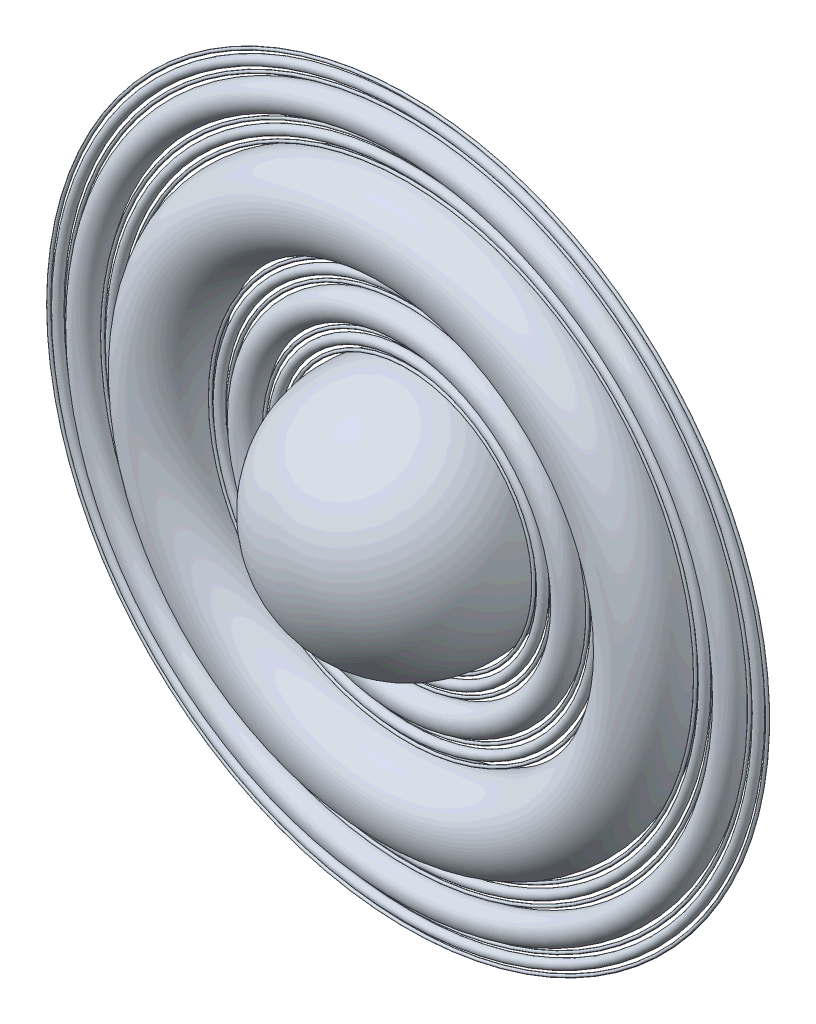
from build123d import *

# Parameters (mm, degrees)
SKETCH730_R = 1093.5
SKETCH731_R = 364.5
SKETCH732_R = 364.5
SKETCH733_R = 121.5
SKETCH734_R = 121.5
SKETCH735_R = 121.5
SKETCH736_R = 121.5
SKETCH737_R = 40.5
SKETCH738_R = 40.5
SKETCH739_R = 40.5
SKETCH740_R = 40.5
SKETCH741_R = 40.5
SKETCH742_R = 40.5
SKETCH743_R = 40.5
SKETCH744_R = 40.5


with BuildPart() as part:
    # Sketch0 → Revolve 0 (revolve)
    with BuildSketch(Plane.XY):
        with BuildLine():
            Line((3280.5, 0), (-3280.5, 0))
            ThreePointArc((-3280.5, 0), (0, 3280.5), (3280.5, 0))
        make_face()
    revolve(axis=Axis((3280.5, 0, 0), (-1, 0, 0)))


with BuildPart() as body_2:
    # Sketch730 → Revolve 0 _1 (revolve)
    with BuildSketch(Plane(origin=(0, 0, 0), x_dir=(1, 0, 0), z_dir=(0, 1, 0))):
        with Locations((6561, 0)):
            Circle(SKETCH730_R)
    revolve(axis=Axis((0, 0, -5467.5), (0, 0, -1)))


with BuildPart() as body_3:
    # Sketch731 → Revolve 2 -1 (revolve)
    with BuildSketch(Plane(origin=(0, 0, 0), x_dir=(1, 0, 0), z_dir=(0, 1, 0)), mode=Mode.PRIVATE) as revolve_2_1_sk:
        with Locations((4374, 0)):
            Circle(SKETCH731_R)
    revolve(revolve_2_1_sk.sketch.rotate(Axis((0, 0, -4738.5), (0, 0, 1)), 180), axis=Axis((0, 0, -4738.5), (0, 0, 1)))


with BuildPart() as body_4:
    # Sketch732 → Revolve 2 _1 2 (revolve)
    with BuildSketch(Plane(origin=(0, 0, 0), x_dir=(1, 0, 0), z_dir=(0, 1, 0)), mode=Mode.PRIVATE) as revolve_2_1_2_sk:
        with Locations((8748, 0)):
            Circle(SKETCH732_R)
    revolve(revolve_2_1_2_sk.sketch.rotate(Axis((0, 0, -9112.5), (0, 0, 1)), 180), axis=Axis((0, 0, -9112.5), (0, 0, 1)))


with BuildPart() as body_5:
    # Sketch733 → Revolve 3 -2 -1 (revolve)
    with BuildSketch(Plane(origin=(0, 0, 0), x_dir=(1, 0, 0), z_dir=(0, 1, 0)), mode=Mode.PRIVATE) as revolve_3_2_1_sk:
        with Locations((3645, 0)):
            Circle(SKETCH733_R)
    revolve(revolve_3_2_1_sk.sketch.rotate(Axis((0, 0, -3766.5), (0, 0, 1)), 180), axis=Axis((0, 0, -3766.5), (0, 0, 1)))


with BuildPart() as body_6:
    # Sketch734 → Revolve 3 _2 -1 2 (revolve)
    with BuildSketch(Plane(origin=(0, 0, 0), x_dir=(1, 0, 0), z_dir=(0, 1, 0)), mode=Mode.PRIVATE) as revolve_3_2_1_2_sk:
        with Locations((5103, 0)):
            Circle(SKETCH734_R)
    revolve(revolve_3_2_1_2_sk.sketch.rotate(Axis((0, 0, -5224.5), (0, 0, 1)), 180), axis=Axis((0, 0, -5224.5), (0, 0, 1)))


with BuildPart() as body_7:
    # Sketch735 → Revolve 3 -2 _1 3 (revolve)
    with BuildSketch(Plane(origin=(0, 0, 0), x_dir=(1, 0, 0), z_dir=(0, 1, 0)), mode=Mode.PRIVATE) as revolve_3_2_1_3_sk:
        with Locations((8019, 0)):
            Circle(SKETCH735_R)
    revolve(revolve_3_2_1_3_sk.sketch.rotate(Axis((0, 0, -8140.5), (0, 0, 1)), 180), axis=Axis((0, 0, -8140.5), (0, 0, 1)))


with BuildPart() as body_8:
    # Sketch736 → Revolve 3 _2 _1 4 (revolve)
    with BuildSketch(Plane(origin=(0, 0, 0), x_dir=(1, 0, 0), z_dir=(0, 1, 0)), mode=Mode.PRIVATE) as revolve_3_2_1_4_sk:
        with Locations((9477, 0)):
            Circle(SKETCH736_R)
    revolve(revolve_3_2_1_4_sk.sketch.rotate(Axis((0, 0, -9598.5), (0, 0, 1)), 180), axis=Axis((0, 0, -9598.5), (0, 0, 1)))


with BuildPart() as body_9:
    # Sketch737 → Revolve 4 -3 -2 -1 (revolve)
    with BuildSketch(Plane(origin=(0, 0, 0), x_dir=(1, 0, 0), z_dir=(0, 1, 0)), mode=Mode.PRIVATE) as revolve_4_3_2_1_sk:
        with Locations((3402, 0)):
            Circle(SKETCH737_R)
    revolve(revolve_4_3_2_1_sk.sketch.rotate(Axis((0, 0, -3442.5), (0, 0, 1)), 180), axis=Axis((0, 0, -3442.5), (0, 0, 1)))


with BuildPart() as body_10:
    # Sketch738 → Revolve 4 _3 -2 -1 2 (revolve)
    with BuildSketch(Plane(origin=(0, 0, 0), x_dir=(1, 0, 0), z_dir=(0, 1, 0)), mode=Mode.PRIVATE) as revolve_4_3_2_1_2_sk:
        with Locations((3888, 0)):
            Circle(SKETCH738_R)
    revolve(revolve_4_3_2_1_2_sk.sketch.rotate(Axis((0, 0, -3928.5), (0, 0, 1)), 180), axis=Axis((0, 0, -3928.5), (0, 0, 1)))


with BuildPart() as body_11:
    # Sketch739 → Revolve 4 -3 _2 -1 3 (revolve)
    with BuildSketch(Plane(origin=(0, 0, 0), x_dir=(1, 0, 0), z_dir=(0, 1, 0)), mode=Mode.PRIVATE) as revolve_4_3_2_1_3_sk:
        with Locations((4860, 0)):
            Circle(SKETCH739_R)
    revolve(revolve_4_3_2_1_3_sk.sketch.rotate(Axis((0, 0, -4900.5), (0, 0, 1)), 180), axis=Axis((0, 0, -4900.5), (0, 0, 1)))


with BuildPart() as body_12:
    # Sketch740 → Revolve 4 _3 _2 -1 4 (revolve)
    with BuildSketch(Plane(origin=(0, 0, 0), x_dir=(1, 0, 0), z_dir=(0, 1, 0)), mode=Mode.PRIVATE) as revolve_4_3_2_1_4_sk:
        with Locations((5346, 0)):
            Circle(SKETCH740_R)
    revolve(revolve_4_3_2_1_4_sk.sketch.rotate(Axis((0, 0, -5386.5), (0, 0, 1)), 180), axis=Axis((0, 0, -5386.5), (0, 0, 1)))


with BuildPart() as body_13:
    # Sketch741 → Revolve 4 -3 -2 _1 5 (revolve)
    with BuildSketch(Plane(origin=(0, 0, 0), x_dir=(1, 0, 0), z_dir=(0, 1, 0)), mode=Mode.PRIVATE) as revolve_4_3_2_1_5_sk:
        with Locations((7776, 0)):
            Circle(SKETCH741_R)
    revolve(revolve_4_3_2_1_5_sk.sketch.rotate(Axis((0, 0, -7816.5), (0, 0, 1)), 180), axis=Axis((0, 0, -7816.5), (0, 0, 1)))


with BuildPart() as body_14:
    # Sketch742 → Revolve 4 _3 -2 _1 6 (revolve)
    with BuildSketch(Plane(origin=(0, 0, 0), x_dir=(1, 0, 0), z_dir=(0, 1, 0)), mode=Mode.PRIVATE) as revolve_4_3_2_1_6_sk:
        with Locations((8262, 0)):
            Circle(SKETCH742_R)
    revolve(revolve_4_3_2_1_6_sk.sketch.rotate(Axis((0, 0, -8302.5), (0, 0, 1)), 180), axis=Axis((0, 0, -8302.5), (0, 0, 1)))


with BuildPart() as body_15:
    # Sketch743 → Revolve 4 -3 _2 _1 7 (revolve)
    with BuildSketch(Plane(origin=(0, 0, 0), x_dir=(1, 0, 0), z_dir=(0, 1, 0)), mode=Mode.PRIVATE) as revolve_4_3_2_1_7_sk:
        with Locations((9234, 0)):
            Circle(SKETCH743_R)
    revolve(revolve_4_3_2_1_7_sk.sketch.rotate(Axis((0, 0, -9274.5), (0, 0, 1)), 180), axis=Axis((0, 0, -9274.5), (0, 0, 1)))


with BuildPart() as body_16:
    # Sketch744 → Revolve 4 _3 _2 _1 8 (revolve)
    with BuildSketch(Plane(origin=(0, 0, 0), x_dir=(1, 0, 0), z_dir=(0, 1, 0)), mode=Mode.PRIVATE) as revolve_4_3_2_1_8_sk:
        with Locations((9720, 0)):
            Circle(SKETCH744_R)
    revolve(revolve_4_3_2_1_8_sk.sketch.rotate(Axis((0, 0, -9760.5), (0, 0, 1)), 180), axis=Axis((0, 0, -9760.5), (0, 0, 1)))


solid = Compound([part.part, body_2.part, body_3.part, body_4.part, body_5.part, body_6.part, body_7.part, body_8.part, body_9.part, body_10.part, body_11.part, body_12.part, body_13.part, body_14.part, body_15.part, body_16.part])
